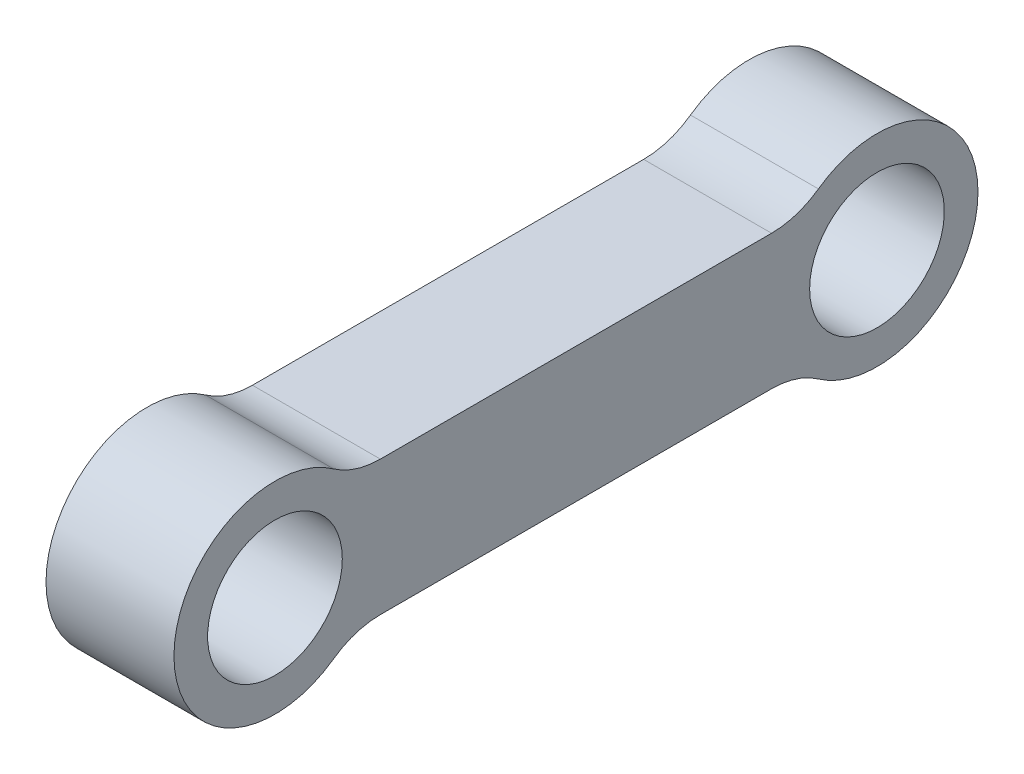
ISO-10303-21;
HEADER;
FILE_DESCRIPTION(('STEP AP214'),'2;1');
FILE_NAME('part.step','',(''),(''),'','','');
FILE_SCHEMA(('AUTOMOTIVE_DESIGN { 1 0 10303 214 1 1 1 1 }'));
ENDSEC;
DATA;
#1=APPLICATION_CONTEXT('core data for automotive mechanical design processes');
#2=APPLICATION_PROTOCOL_DEFINITION('international standard','automotive_design',2000,#1);
#3=PRODUCT_CONTEXT('',#1,'mechanical');
#4=PRODUCT('Part','Part','',(#3));
#5=PRODUCT_RELATED_PRODUCT_CATEGORY('part','',(#4));
#6=PRODUCT_DEFINITION_FORMATION('','',#4);
#7=PRODUCT_DEFINITION_CONTEXT('part definition',#1,'design');
#8=PRODUCT_DEFINITION('design','',#6,#7);
#9=PRODUCT_DEFINITION_SHAPE('','',#8);
#10=(LENGTH_UNIT() NAMED_UNIT(*) SI_UNIT(.MILLI.,.METRE.));
#11=(NAMED_UNIT(*) PLANE_ANGLE_UNIT() SI_UNIT($,.RADIAN.));
#12=(NAMED_UNIT(*) SI_UNIT($,.STERADIAN.) SOLID_ANGLE_UNIT());
#13=UNCERTAINTY_MEASURE_WITH_UNIT(LENGTH_MEASURE(1.E-05),#10,'distance_accuracy_value','');
#14=(GEOMETRIC_REPRESENTATION_CONTEXT(3) GLOBAL_UNCERTAINTY_ASSIGNED_CONTEXT((#13)) GLOBAL_UNIT_ASSIGNED_CONTEXT((#10,
#11,#12)) REPRESENTATION_CONTEXT('',''));
#15=CARTESIAN_POINT('',(0.,0.,0.));
#16=DIRECTION('',(0.,0.,1.));
#17=DIRECTION('',(1.,0.,0.));
#18=AXIS2_PLACEMENT_3D('',#15,#16,#17);
#19=CARTESIAN_POINT('',(4.75,0.,22.35));
#20=DIRECTION('',(1.,0.,0.));
#21=DIRECTION('',(0.,0.,-1.));
#22=AXIS2_PLACEMENT_3D('',#19,#20,#21);
#23=PLANE('',#22);
#24=CARTESIAN_POINT('',(4.75,0.,22.35));
#25=DIRECTION('',(1.,0.,0.));
#26=DIRECTION('',(0.,0.,-1.));
#27=AXIS2_PLACEMENT_3D('',#24,#25,#26);
#28=CIRCLE('',#27,5.);
#29=CARTESIAN_POINT('',(4.75,0.,17.35));
#30=VERTEX_POINT('',#29);
#31=EDGE_CURVE('E180',#30,#30,#28,.T.);
#32=ORIENTED_EDGE('',*,*,#31,.F.);
#33=EDGE_LOOP('',(#32));
#34=FACE_BOUND('',#33,.T.);
#35=DIRECTION('',(0.,0.,1.));
#36=VECTOR('',#35,1.);
#37=CARTESIAN_POINT('',(4.75,5.,16.7598300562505));
#38=LINE('',#37,#36);
#39=CARTESIAN_POINT('',(4.75,5.0000000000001,-14.5237620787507));
#40=VERTEX_POINT('',#39);
#41=CARTESIAN_POINT('',(4.75,5.00000000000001,14.5237620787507));
#42=VERTEX_POINT('',#41);
#43=EDGE_CURVE('E137',#40,#42,#38,.T.);
#44=ORIENTED_EDGE('',*,*,#43,.T.);
#45=CARTESIAN_POINT('',(4.75,11.,14.5237620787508));
#46=DIRECTION('',(1.,0.,0.));
#47=DIRECTION('',(0.,0.,-1.));
#48=AXIS2_PLACEMENT_3D('',#45,#46,#47);
#49=CIRCLE('',#48,6.);
#50=CARTESIAN_POINT('',(4.75,6.11111111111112,18.0020900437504));
#51=VERTEX_POINT('',#50);
#52=EDGE_CURVE('E158',#42,#51,#49,.F.);
#53=ORIENTED_EDGE('',*,*,#52,.T.);
#54=CARTESIAN_POINT('',(4.75,0.,22.35));
#55=DIRECTION('',(1.,0.,0.));
#56=DIRECTION('',(0.,0.,-1.));
#57=AXIS2_PLACEMENT_3D('',#54,#55,#56);
#58=CIRCLE('',#57,7.5);
#59=CARTESIAN_POINT('',(4.75,-6.11111111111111,18.0020900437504));
#60=VERTEX_POINT('',#59);
#61=EDGE_CURVE('E131',#51,#60,#58,.T.);
#62=ORIENTED_EDGE('',*,*,#61,.T.);
#63=CARTESIAN_POINT('',(4.75,-11.,14.5237620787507));
#64=DIRECTION('',(1.,0.,0.));
#65=DIRECTION('',(0.,0.,-1.));
#66=AXIS2_PLACEMENT_3D('',#63,#64,#65);
#67=CIRCLE('',#66,6.);
#68=CARTESIAN_POINT('',(4.75,-4.99999999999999,14.5237620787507));
#69=VERTEX_POINT('',#68);
#70=EDGE_CURVE('E154',#60,#69,#67,.F.);
#71=ORIENTED_EDGE('',*,*,#70,.T.);
#72=DIRECTION('',(0.,0.,-1.));
#73=VECTOR('',#72,1.);
#74=CARTESIAN_POINT('',(4.75,-5.,16.7598300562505));
#75=LINE('',#74,#73);
#76=CARTESIAN_POINT('',(4.75,-4.9999999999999,-14.5237620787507));
#77=VERTEX_POINT('',#76);
#78=EDGE_CURVE('E170',#69,#77,#75,.T.);
#79=ORIENTED_EDGE('',*,*,#78,.T.);
#80=CARTESIAN_POINT('',(4.75,-10.9999999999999,-14.5237620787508));
#81=DIRECTION('',(1.,0.,0.));
#82=DIRECTION('',(0.,0.,-1.));
#83=AXIS2_PLACEMENT_3D('',#80,#81,#82);
#84=CIRCLE('',#83,6.);
#85=CARTESIAN_POINT('',(4.75,-6.11111111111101,-18.0020900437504));
#86=VERTEX_POINT('',#85);
#87=EDGE_CURVE('E112',#77,#86,#84,.F.);
#88=ORIENTED_EDGE('',*,*,#87,.T.);
#89=CARTESIAN_POINT('',(4.75,1.11022302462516E-13,-22.35));
#90=DIRECTION('',(1.,0.,0.));
#91=DIRECTION('',(0.,0.,1.));
#92=AXIS2_PLACEMENT_3D('',#89,#90,#91);
#93=CIRCLE('',#92,7.5);
#94=CARTESIAN_POINT('',(4.75,6.11111111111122,-18.0020900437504));
#95=VERTEX_POINT('',#94);
#96=EDGE_CURVE('E120',#86,#95,#93,.T.);
#97=ORIENTED_EDGE('',*,*,#96,.T.);
#98=CARTESIAN_POINT('',(4.75,11.0000000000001,-14.5237620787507));
#99=DIRECTION('',(1.,0.,0.));
#100=DIRECTION('',(0.,0.,-1.));
#101=AXIS2_PLACEMENT_3D('',#98,#99,#100);
#102=CIRCLE('',#101,6.);
#103=EDGE_CURVE('E11',#95,#40,#102,.F.);
#104=ORIENTED_EDGE('',*,*,#103,.T.);
#105=EDGE_LOOP('',(#44,#53,#62,#71,#79,#88,#97,#104));
#106=FACE_BOUND('',#105,.T.);
#107=CARTESIAN_POINT('',(4.75,1.11022302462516E-13,-22.35));
#108=DIRECTION('',(1.,0.,0.));
#109=DIRECTION('',(0.,0.,1.));
#110=AXIS2_PLACEMENT_3D('',#107,#108,#109);
#111=CIRCLE('',#110,5.);
#112=CARTESIAN_POINT('',(4.75,1.11022302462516E-13,-17.35));
#113=VERTEX_POINT('',#112);
#114=EDGE_CURVE('E187',#113,#113,#111,.T.);
#115=ORIENTED_EDGE('',*,*,#114,.F.);
#116=EDGE_LOOP('',(#115));
#117=FACE_BOUND('',#116,.T.);
#118=ADVANCED_FACE('F37',(#34,#106,#117),#23,.T.);
#119=CARTESIAN_POINT('',(-4.75,0.,22.35));
#120=DIRECTION('',(1.,0.,0.));
#121=DIRECTION('',(0.,0.,-1.));
#122=AXIS2_PLACEMENT_3D('',#119,#120,#121);
#123=PLANE('',#122);
#124=CARTESIAN_POINT('',(-4.75,0.,22.35));
#125=DIRECTION('',(1.,0.,0.));
#126=DIRECTION('',(0.,0.,-1.));
#127=AXIS2_PLACEMENT_3D('',#124,#125,#126);
#128=CIRCLE('',#127,7.5);
#129=CARTESIAN_POINT('',(-4.75,6.11111111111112,18.0020900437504));
#130=VERTEX_POINT('',#129);
#131=CARTESIAN_POINT('',(-4.75,-6.11111111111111,18.0020900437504));
#132=VERTEX_POINT('',#131);
#133=EDGE_CURVE('E133',#130,#132,#128,.T.);
#134=ORIENTED_EDGE('',*,*,#133,.F.);
#135=CARTESIAN_POINT('',(-4.75,11.,14.5237620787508));
#136=DIRECTION('',(1.,0.,0.));
#137=DIRECTION('',(0.,0.,-1.));
#138=AXIS2_PLACEMENT_3D('',#135,#136,#137);
#139=CIRCLE('',#138,6.);
#140=CARTESIAN_POINT('',(-4.75,5.00000000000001,14.5237620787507));
#141=VERTEX_POINT('',#140);
#142=EDGE_CURVE('E156',#130,#141,#139,.T.);
#143=ORIENTED_EDGE('',*,*,#142,.T.);
#144=DIRECTION('',(0.,0.,1.));
#145=VECTOR('',#144,1.);
#146=CARTESIAN_POINT('',(-4.75,5.,16.7598300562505));
#147=LINE('',#146,#145);
#148=CARTESIAN_POINT('',(-4.75,5.0000000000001,-14.5237620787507));
#149=VERTEX_POINT('',#148);
#150=EDGE_CURVE('E128',#149,#141,#147,.T.);
#151=ORIENTED_EDGE('',*,*,#150,.F.);
#152=CARTESIAN_POINT('',(-4.75,11.0000000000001,-14.5237620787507));
#153=DIRECTION('',(1.,0.,0.));
#154=DIRECTION('',(0.,0.,-1.));
#155=AXIS2_PLACEMENT_3D('',#152,#153,#154);
#156=CIRCLE('',#155,6.);
#157=CARTESIAN_POINT('',(-4.75,6.11111111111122,-18.0020900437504));
#158=VERTEX_POINT('',#157);
#159=EDGE_CURVE('E45',#149,#158,#156,.T.);
#160=ORIENTED_EDGE('',*,*,#159,.T.);
#161=CARTESIAN_POINT('',(-4.75,1.11022302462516E-13,-22.35));
#162=DIRECTION('',(1.,0.,0.));
#163=DIRECTION('',(0.,0.,1.));
#164=AXIS2_PLACEMENT_3D('',#161,#162,#163);
#165=CIRCLE('',#164,7.5);
#166=CARTESIAN_POINT('',(-4.75,-6.11111111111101,-18.0020900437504));
#167=VERTEX_POINT('',#166);
#168=EDGE_CURVE('E118',#167,#158,#165,.T.);
#169=ORIENTED_EDGE('',*,*,#168,.F.);
#170=CARTESIAN_POINT('',(-4.75,-10.9999999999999,-14.5237620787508));
#171=DIRECTION('',(1.,0.,0.));
#172=DIRECTION('',(0.,0.,-1.));
#173=AXIS2_PLACEMENT_3D('',#170,#171,#172);
#174=CIRCLE('',#173,6.);
#175=CARTESIAN_POINT('',(-4.75,-4.9999999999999,-14.5237620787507));
#176=VERTEX_POINT('',#175);
#177=EDGE_CURVE('E102',#167,#176,#174,.T.);
#178=ORIENTED_EDGE('',*,*,#177,.T.);
#179=DIRECTION('',(0.,0.,-1.));
#180=VECTOR('',#179,1.);
#181=CARTESIAN_POINT('',(-4.75,-5.,16.7598300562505));
#182=LINE('',#181,#180);
#183=CARTESIAN_POINT('',(-4.75,-4.99999999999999,14.5237620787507));
#184=VERTEX_POINT('',#183);
#185=EDGE_CURVE('E129',#184,#176,#182,.T.);
#186=ORIENTED_EDGE('',*,*,#185,.F.);
#187=CARTESIAN_POINT('',(-4.75,-11.,14.5237620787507));
#188=DIRECTION('',(1.,0.,0.));
#189=DIRECTION('',(0.,0.,-1.));
#190=AXIS2_PLACEMENT_3D('',#187,#188,#189);
#191=CIRCLE('',#190,6.);
#192=EDGE_CURVE('E152',#184,#132,#191,.T.);
#193=ORIENTED_EDGE('',*,*,#192,.T.);
#194=EDGE_LOOP('',(#134,#143,#151,#160,#169,#178,#186,#193));
#195=FACE_BOUND('',#194,.T.);
#196=CARTESIAN_POINT('',(-4.75,0.,22.35));
#197=DIRECTION('',(1.,0.,0.));
#198=DIRECTION('',(0.,0.,-1.));
#199=AXIS2_PLACEMENT_3D('',#196,#197,#198);
#200=CIRCLE('',#199,5.);
#201=CARTESIAN_POINT('',(-4.75,0.,17.35));
#202=VERTEX_POINT('',#201);
#203=EDGE_CURVE('E182',#202,#202,#200,.T.);
#204=ORIENTED_EDGE('',*,*,#203,.T.);
#205=EDGE_LOOP('',(#204));
#206=FACE_BOUND('',#205,.T.);
#207=CARTESIAN_POINT('',(-4.75,1.11022302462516E-13,-22.35));
#208=DIRECTION('',(1.,0.,0.));
#209=DIRECTION('',(0.,0.,1.));
#210=AXIS2_PLACEMENT_3D('',#207,#208,#209);
#211=CIRCLE('',#210,5.);
#212=CARTESIAN_POINT('',(-4.75,1.11022302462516E-13,-17.35));
#213=VERTEX_POINT('',#212);
#214=EDGE_CURVE('E190',#213,#213,#211,.T.);
#215=ORIENTED_EDGE('',*,*,#214,.T.);
#216=EDGE_LOOP('',(#215));
#217=FACE_BOUND('',#216,.T.);
#218=ADVANCED_FACE('F125',(#195,#206,#217),#123,.F.);
#219=CARTESIAN_POINT('',(4.75,0.,22.35));
#220=DIRECTION('',(-1.,0.,0.));
#221=DIRECTION('',(0.,0.,1.));
#222=AXIS2_PLACEMENT_3D('',#219,#220,#221);
#223=CYLINDRICAL_SURFACE('',#222,7.5);
#224=ORIENTED_EDGE('',*,*,#133,.T.);
#225=DIRECTION('',(-1.,0.,0.));
#226=VECTOR('',#225,1.);
#227=CARTESIAN_POINT('',(4.75,-6.11111111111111,18.0020900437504));
#228=LINE('',#227,#226);
#229=EDGE_CURVE('E145',#132,#60,#228,.F.);
#230=ORIENTED_EDGE('',*,*,#229,.T.);
#231=ORIENTED_EDGE('',*,*,#61,.F.);
#232=DIRECTION('',(-1.,0.,0.));
#233=VECTOR('',#232,1.);
#234=CARTESIAN_POINT('',(4.75,6.11111111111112,18.0020900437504));
#235=LINE('',#234,#233);
#236=EDGE_CURVE('E142',#51,#130,#235,.T.);
#237=ORIENTED_EDGE('',*,*,#236,.T.);
#238=EDGE_LOOP('',(#224,#230,#231,#237));
#239=FACE_BOUND('',#238,.T.);
#240=ADVANCED_FACE('F168',(#239),#223,.T.);
#241=CARTESIAN_POINT('',(4.75,-5.,16.7598300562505));
#242=DIRECTION('',(0.,1.,0.));
#243=DIRECTION('',(0.,0.,1.));
#244=AXIS2_PLACEMENT_3D('',#241,#242,#243);
#245=PLANE('',#244);
#246=ORIENTED_EDGE('',*,*,#185,.T.);
#247=DIRECTION('',(1.,0.,0.));
#248=VECTOR('',#247,1.);
#249=CARTESIAN_POINT('',(4.75,-4.9999999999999,-14.5237620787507));
#250=LINE('',#249,#248);
#251=EDGE_CURVE('E107',#176,#77,#250,.T.);
#252=ORIENTED_EDGE('',*,*,#251,.T.);
#253=ORIENTED_EDGE('',*,*,#78,.F.);
#254=DIRECTION('',(1.,0.,0.));
#255=VECTOR('',#254,1.);
#256=CARTESIAN_POINT('',(-4.75,-4.99999999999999,14.5237620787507));
#257=LINE('',#256,#255);
#258=EDGE_CURVE('E121',#69,#184,#257,.F.);
#259=ORIENTED_EDGE('',*,*,#258,.T.);
#260=EDGE_LOOP('',(#246,#252,#253,#259));
#261=FACE_BOUND('',#260,.T.);
#262=ADVANCED_FACE('F214',(#261),#245,.F.);
#263=CARTESIAN_POINT('',(4.75,1.11022302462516E-13,-22.35));
#264=DIRECTION('',(-1.,0.,0.));
#265=DIRECTION('',(0.,0.,1.));
#266=AXIS2_PLACEMENT_3D('',#263,#264,#265);
#267=CYLINDRICAL_SURFACE('',#266,7.5);
#268=ORIENTED_EDGE('',*,*,#96,.F.);
#269=DIRECTION('',(-1.,0.,0.));
#270=VECTOR('',#269,1.);
#271=CARTESIAN_POINT('',(4.75,-6.11111111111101,-18.0020900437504));
#272=LINE('',#271,#270);
#273=EDGE_CURVE('E106',#86,#167,#272,.T.);
#274=ORIENTED_EDGE('',*,*,#273,.T.);
#275=ORIENTED_EDGE('',*,*,#168,.T.);
#276=DIRECTION('',(-1.,0.,0.));
#277=VECTOR('',#276,1.);
#278=CARTESIAN_POINT('',(4.75,6.11111111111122,-18.0020900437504));
#279=LINE('',#278,#277);
#280=EDGE_CURVE('E122',#158,#95,#279,.F.);
#281=ORIENTED_EDGE('',*,*,#280,.T.);
#282=EDGE_LOOP('',(#268,#274,#275,#281));
#283=FACE_BOUND('',#282,.T.);
#284=ADVANCED_FACE('F117',(#283),#267,.T.);
#285=CARTESIAN_POINT('',(4.75,5.,16.7598300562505));
#286=DIRECTION('',(0.,-1.,0.));
#287=DIRECTION('',(0.,0.,-1.));
#288=AXIS2_PLACEMENT_3D('',#285,#286,#287);
#289=PLANE('',#288);
#290=ORIENTED_EDGE('',*,*,#150,.T.);
#291=DIRECTION('',(1.,0.,0.));
#292=VECTOR('',#291,1.);
#293=CARTESIAN_POINT('',(4.75,5.00000000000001,14.5237620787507));
#294=LINE('',#293,#292);
#295=EDGE_CURVE('E52',#141,#42,#294,.T.);
#296=ORIENTED_EDGE('',*,*,#295,.T.);
#297=ORIENTED_EDGE('',*,*,#43,.F.);
#298=DIRECTION('',(1.,0.,0.));
#299=VECTOR('',#298,1.);
#300=CARTESIAN_POINT('',(-4.75,5.0000000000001,-14.5237620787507));
#301=LINE('',#300,#299);
#302=EDGE_CURVE('E147',#40,#149,#301,.F.);
#303=ORIENTED_EDGE('',*,*,#302,.T.);
#304=EDGE_LOOP('',(#290,#296,#297,#303));
#305=FACE_BOUND('',#304,.T.);
#306=ADVANCED_FACE('F173',(#305),#289,.F.);
#307=CARTESIAN_POINT('',(4.75,0.,22.35));
#308=DIRECTION('',(-1.,0.,0.));
#309=DIRECTION('',(0.,0.,1.));
#310=AXIS2_PLACEMENT_3D('',#307,#308,#309);
#311=CYLINDRICAL_SURFACE('',#310,5.);
#312=ORIENTED_EDGE('',*,*,#31,.T.);
#313=EDGE_LOOP('',(#312));
#314=FACE_BOUND('',#313,.T.);
#315=ORIENTED_EDGE('',*,*,#203,.F.);
#316=EDGE_LOOP('',(#315));
#317=FACE_BOUND('',#316,.T.);
#318=ADVANCED_FACE('F207',(#314,#317),#311,.F.);
#319=CARTESIAN_POINT('',(4.75,1.11022302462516E-13,-22.35));
#320=DIRECTION('',(-1.,0.,0.));
#321=DIRECTION('',(0.,0.,1.));
#322=AXIS2_PLACEMENT_3D('',#319,#320,#321);
#323=CYLINDRICAL_SURFACE('',#322,5.);
#324=ORIENTED_EDGE('',*,*,#114,.T.);
#325=EDGE_LOOP('',(#324));
#326=FACE_BOUND('',#325,.T.);
#327=ORIENTED_EDGE('',*,*,#214,.F.);
#328=EDGE_LOOP('',(#327));
#329=FACE_BOUND('',#328,.T.);
#330=ADVANCED_FACE('F196',(#326,#329),#323,.F.);
#331=CARTESIAN_POINT('',(4.75,-10.9999999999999,-14.5237620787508));
#332=DIRECTION('',(-1.,0.,0.));
#333=DIRECTION('',(0.,0.,1.));
#334=AXIS2_PLACEMENT_3D('',#331,#332,#333);
#335=CYLINDRICAL_SURFACE('',#334,6.);
#336=ORIENTED_EDGE('',*,*,#87,.F.);
#337=ORIENTED_EDGE('',*,*,#251,.F.);
#338=ORIENTED_EDGE('',*,*,#177,.F.);
#339=ORIENTED_EDGE('',*,*,#273,.F.);
#340=EDGE_LOOP('',(#336,#337,#338,#339));
#341=FACE_BOUND('',#340,.T.);
#342=ADVANCED_FACE('F105',(#341),#335,.F.);
#343=CARTESIAN_POINT('',(4.75,-11.,14.5237620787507));
#344=DIRECTION('',(-1.,0.,0.));
#345=DIRECTION('',(0.,0.,1.));
#346=AXIS2_PLACEMENT_3D('',#343,#344,#345);
#347=CYLINDRICAL_SURFACE('',#346,6.);
#348=ORIENTED_EDGE('',*,*,#70,.F.);
#349=ORIENTED_EDGE('',*,*,#229,.F.);
#350=ORIENTED_EDGE('',*,*,#192,.F.);
#351=ORIENTED_EDGE('',*,*,#258,.F.);
#352=EDGE_LOOP('',(#348,#349,#350,#351));
#353=FACE_BOUND('',#352,.T.);
#354=ADVANCED_FACE('F222',(#353),#347,.F.);
#355=CARTESIAN_POINT('',(4.75,11.,14.5237620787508));
#356=DIRECTION('',(-1.,0.,0.));
#357=DIRECTION('',(0.,0.,1.));
#358=AXIS2_PLACEMENT_3D('',#355,#356,#357);
#359=CYLINDRICAL_SURFACE('',#358,6.);
#360=ORIENTED_EDGE('',*,*,#52,.F.);
#361=ORIENTED_EDGE('',*,*,#295,.F.);
#362=ORIENTED_EDGE('',*,*,#142,.F.);
#363=ORIENTED_EDGE('',*,*,#236,.F.);
#364=EDGE_LOOP('',(#360,#361,#362,#363));
#365=FACE_BOUND('',#364,.T.);
#366=ADVANCED_FACE('F172',(#365),#359,.F.);
#367=CARTESIAN_POINT('',(4.75,11.0000000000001,-14.5237620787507));
#368=DIRECTION('',(-1.,0.,0.));
#369=DIRECTION('',(0.,0.,1.));
#370=AXIS2_PLACEMENT_3D('',#367,#368,#369);
#371=CYLINDRICAL_SURFACE('',#370,6.);
#372=ORIENTED_EDGE('',*,*,#103,.F.);
#373=ORIENTED_EDGE('',*,*,#280,.F.);
#374=ORIENTED_EDGE('',*,*,#159,.F.);
#375=ORIENTED_EDGE('',*,*,#302,.F.);
#376=EDGE_LOOP('',(#372,#373,#374,#375));
#377=FACE_BOUND('',#376,.T.);
#378=ADVANCED_FACE('F39',(#377),#371,.F.);
#379=CLOSED_SHELL('',(#118,#218,#240,#262,#284,#306,#318,#330,#342,#354,#366,#378));
#380=MANIFOLD_SOLID_BREP('B2',#379);
#381=ADVANCED_BREP_SHAPE_REPRESENTATION('',(#18,#380),#14);
#382=SHAPE_DEFINITION_REPRESENTATION(#9,#381);
ENDSEC;
END-ISO-10303-21;
